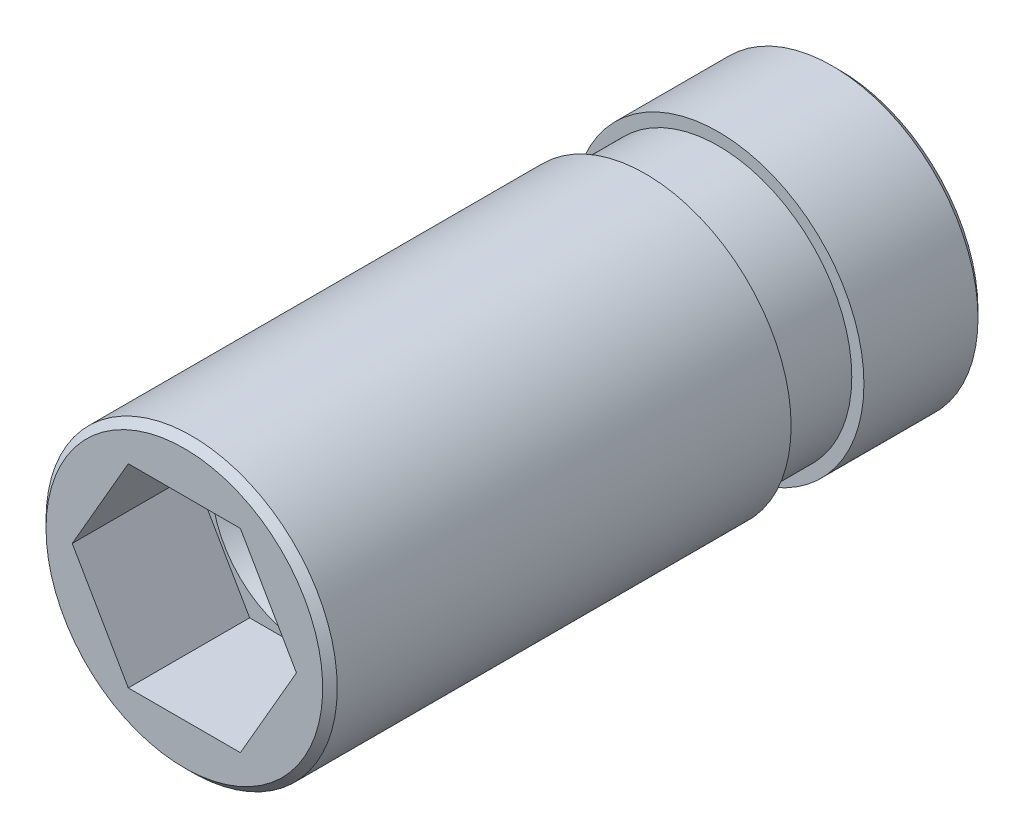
from build123d import *

# Parameters (mm, degrees)
ENL_V_MAT_EXTRU_1_DEPTH = 5
CHANFREIN1_SIZE         = 0.3
ESQUISSE3_R             = 3.375
ENL_V_MAT_EXTRU_2_DEPTH = 22
CHANFREIN2_SIZE         = 0.5


with BuildPart() as part:
    # Esquisse1 → Base-R_volution (revolve)
    with BuildSketch(Plane(origin=(0, 0, 0), x_dir=(0, 0, -1), z_dir=(1, 0, 0)), mode=Mode.PRIVATE) as base_r_volution_sk:
        Polygon((0, 0), (0, 6), (19, 6), (19, 5.5), (22, 5.5), (22, 6), (27, 6), (27, 0), align=None)
    revolve(base_r_volution_sk.sketch.rotate(Axis((0, 0, 40), (0, 0, -1)), 90), axis=Axis((0, 0, 40), (0, 0, -1)))

    # Esquisse2 → Enl_v. mat.-Extru.1 (cut)
    with BuildSketch(Plane.XY):
        Polygon((-4.618802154, 0), (-2.309401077, -4), (2.309401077, -4), (4.618802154, 0), (2.309401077, 4), (-2.309401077, 4), align=None)
    extrude(amount=-ENL_V_MAT_EXTRU_1_DEPTH, mode=Mode.SUBTRACT)

    # Chanfrein1
    chanfrein1_edges = [part.edges().sort_by_distance(p)[0] for p in [
        (-6, 0, 0),
        (-6, 0, -27),
    ]]
    chamfer(chanfrein1_edges, length=CHANFREIN1_SIZE)

    # Esquisse3 → Enl_v. mat.-Extru.2 (cut)
    with BuildSketch(Plane.XY.offset(-5)):
        Circle(ESQUISSE3_R)
    extrude(amount=-ENL_V_MAT_EXTRU_2_DEPTH, mode=Mode.SUBTRACT)

    # Chanfrein2
    chanfrein2_edges = [part.edges().sort_by_distance(p)[0] for p in [
        (-3.375, 0, -5),
        (-3.375, 0, -27),
    ]]
    chamfer(chanfrein2_edges, length=CHANFREIN2_SIZE)


solid = part.part
